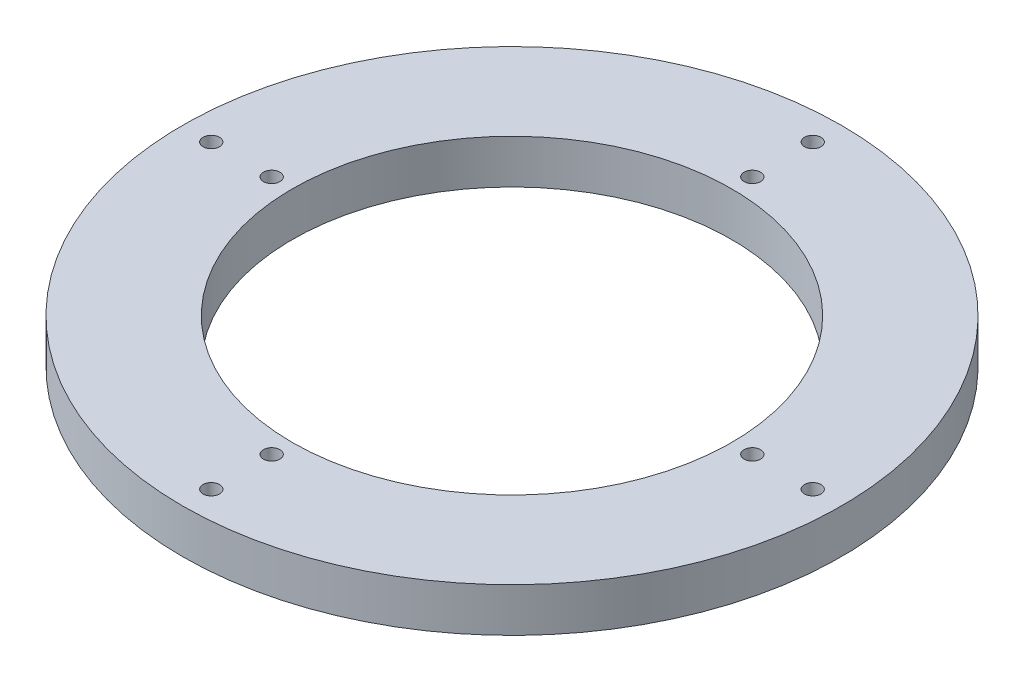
ISO-10303-21;
HEADER;
FILE_DESCRIPTION(('STEP AP214'),'2;1');
FILE_NAME('part.step','',(''),(''),'','','');
FILE_SCHEMA(('AUTOMOTIVE_DESIGN { 1 0 10303 214 1 1 1 1 }'));
ENDSEC;
DATA;
#1=APPLICATION_CONTEXT('core data for automotive mechanical design processes');
#2=APPLICATION_PROTOCOL_DEFINITION('international standard','automotive_design',2000,#1);
#3=PRODUCT_CONTEXT('',#1,'mechanical');
#4=PRODUCT('Part','Part','',(#3));
#5=PRODUCT_RELATED_PRODUCT_CATEGORY('part','',(#4));
#6=PRODUCT_DEFINITION_FORMATION('','',#4);
#7=PRODUCT_DEFINITION_CONTEXT('part definition',#1,'design');
#8=PRODUCT_DEFINITION('design','',#6,#7);
#9=PRODUCT_DEFINITION_SHAPE('','',#8);
#10=(LENGTH_UNIT() NAMED_UNIT(*) SI_UNIT(.MILLI.,.METRE.));
#11=(NAMED_UNIT(*) PLANE_ANGLE_UNIT() SI_UNIT($,.RADIAN.));
#12=(NAMED_UNIT(*) SI_UNIT($,.STERADIAN.) SOLID_ANGLE_UNIT());
#13=UNCERTAINTY_MEASURE_WITH_UNIT(LENGTH_MEASURE(1.E-05),#10,'distance_accuracy_value','');
#14=(GEOMETRIC_REPRESENTATION_CONTEXT(3) GLOBAL_UNCERTAINTY_ASSIGNED_CONTEXT((#13)) GLOBAL_UNIT_ASSIGNED_CONTEXT((#10,
#11,#12)) REPRESENTATION_CONTEXT('',''));
#15=CARTESIAN_POINT('',(0.,0.,0.));
#16=DIRECTION('',(0.,0.,1.));
#17=DIRECTION('',(1.,0.,0.));
#18=AXIS2_PLACEMENT_3D('',#15,#16,#17);
#19=CARTESIAN_POINT('',(0.,8.,0.));
#20=DIRECTION('',(0.,-1.,0.));
#21=DIRECTION('',(0.,0.,-1.));
#22=AXIS2_PLACEMENT_3D('',#19,#20,#21);
#23=CYLINDRICAL_SURFACE('',#22,40.);
#24=CARTESIAN_POINT('',(0.,8.,0.));
#25=DIRECTION('',(0.,1.,0.));
#26=DIRECTION('',(0.,0.,1.));
#27=AXIS2_PLACEMENT_3D('',#24,#25,#26);
#28=CIRCLE('',#27,40.);
#29=CARTESIAN_POINT('',(0.,8.,40.));
#30=VERTEX_POINT('',#29);
#31=EDGE_CURVE('E41',#30,#30,#28,.T.);
#32=ORIENTED_EDGE('',*,*,#31,.T.);
#33=EDGE_LOOP('',(#32));
#34=FACE_BOUND('',#33,.T.);
#35=CARTESIAN_POINT('',(0.,0.,0.));
#36=DIRECTION('',(0.,1.,0.));
#37=DIRECTION('',(0.,0.,1.));
#38=AXIS2_PLACEMENT_3D('',#35,#36,#37);
#39=CIRCLE('',#38,40.);
#40=CARTESIAN_POINT('',(0.,0.,40.));
#41=VERTEX_POINT('',#40);
#42=EDGE_CURVE('E73',#41,#41,#39,.T.);
#43=ORIENTED_EDGE('',*,*,#42,.F.);
#44=EDGE_LOOP('',(#43));
#45=FACE_BOUND('',#44,.T.);
#46=ADVANCED_FACE('F33',(#34,#45),#23,.F.);
#47=CARTESIAN_POINT('',(54.75,8.,0.));
#48=DIRECTION('',(0.,-1.,0.));
#49=DIRECTION('',(0.,0.,-1.));
#50=AXIS2_PLACEMENT_3D('',#47,#48,#49);
#51=CYLINDRICAL_SURFACE('',#50,1.5);
#52=CARTESIAN_POINT('',(54.75,8.,0.));
#53=DIRECTION('',(0.,1.,0.));
#54=DIRECTION('',(0.,0.,1.));
#55=AXIS2_PLACEMENT_3D('',#52,#53,#54);
#56=CIRCLE('',#55,1.5);
#57=CARTESIAN_POINT('',(54.75,8.,1.5));
#58=VERTEX_POINT('',#57);
#59=EDGE_CURVE('E46',#58,#58,#56,.T.);
#60=ORIENTED_EDGE('',*,*,#59,.T.);
#61=EDGE_LOOP('',(#60));
#62=FACE_BOUND('',#61,.T.);
#63=CARTESIAN_POINT('',(54.75,0.,0.));
#64=DIRECTION('',(0.,1.,0.));
#65=DIRECTION('',(0.,0.,1.));
#66=AXIS2_PLACEMENT_3D('',#63,#64,#65);
#67=CIRCLE('',#66,1.5);
#68=CARTESIAN_POINT('',(54.75,0.,1.5));
#69=VERTEX_POINT('',#68);
#70=EDGE_CURVE('E71',#69,#69,#67,.T.);
#71=ORIENTED_EDGE('',*,*,#70,.F.);
#72=EDGE_LOOP('',(#71));
#73=FACE_BOUND('',#72,.T.);
#74=ADVANCED_FACE('F106',(#62,#73),#51,.F.);
#75=CARTESIAN_POINT('',(-1.91158603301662E-13,8.,54.75));
#76=DIRECTION('',(0.,-1.,0.));
#77=DIRECTION('',(0.,0.,-1.));
#78=AXIS2_PLACEMENT_3D('',#75,#76,#77);
#79=CYLINDRICAL_SURFACE('',#78,1.5);
#80=CARTESIAN_POINT('',(-1.91158603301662E-13,8.,54.75));
#81=DIRECTION('',(0.,1.,0.));
#82=DIRECTION('',(0.,0.,1.));
#83=AXIS2_PLACEMENT_3D('',#80,#81,#82);
#84=CIRCLE('',#83,1.5);
#85=CARTESIAN_POINT('',(-1.91158603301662E-13,8.,56.25));
#86=VERTEX_POINT('',#85);
#87=EDGE_CURVE('E101',#86,#86,#84,.T.);
#88=ORIENTED_EDGE('',*,*,#87,.T.);
#89=EDGE_LOOP('',(#88));
#90=FACE_BOUND('',#89,.T.);
#91=CARTESIAN_POINT('',(-1.91158603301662E-13,0.,54.75));
#92=DIRECTION('',(0.,1.,0.));
#93=DIRECTION('',(0.,0.,1.));
#94=AXIS2_PLACEMENT_3D('',#91,#92,#93);
#95=CIRCLE('',#94,1.5);
#96=CARTESIAN_POINT('',(-1.91158603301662E-13,0.,56.25));
#97=VERTEX_POINT('',#96);
#98=EDGE_CURVE('E68',#97,#97,#95,.T.);
#99=ORIENTED_EDGE('',*,*,#98,.F.);
#100=EDGE_LOOP('',(#99));
#101=FACE_BOUND('',#100,.T.);
#102=ADVANCED_FACE('F124',(#90,#101),#79,.F.);
#103=CARTESIAN_POINT('',(-54.75,8.,-3.82317206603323E-13));
#104=DIRECTION('',(0.,-1.,0.));
#105=DIRECTION('',(0.,0.,-1.));
#106=AXIS2_PLACEMENT_3D('',#103,#104,#105);
#107=CYLINDRICAL_SURFACE('',#106,1.5);
#108=CARTESIAN_POINT('',(-54.75,8.,-3.82317206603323E-13));
#109=DIRECTION('',(0.,1.,0.));
#110=DIRECTION('',(0.,0.,1.));
#111=AXIS2_PLACEMENT_3D('',#108,#109,#110);
#112=CIRCLE('',#111,1.5);
#113=CARTESIAN_POINT('',(-54.75,8.,1.49999999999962));
#114=VERTEX_POINT('',#113);
#115=EDGE_CURVE('E98',#114,#114,#112,.T.);
#116=ORIENTED_EDGE('',*,*,#115,.T.);
#117=EDGE_LOOP('',(#116));
#118=FACE_BOUND('',#117,.T.);
#119=CARTESIAN_POINT('',(-54.75,0.,-3.82317206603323E-13));
#120=DIRECTION('',(0.,1.,0.));
#121=DIRECTION('',(0.,0.,1.));
#122=AXIS2_PLACEMENT_3D('',#119,#120,#121);
#123=CIRCLE('',#122,1.5);
#124=CARTESIAN_POINT('',(-54.75,0.,1.49999999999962));
#125=VERTEX_POINT('',#124);
#126=EDGE_CURVE('E65',#125,#125,#123,.T.);
#127=ORIENTED_EDGE('',*,*,#126,.F.);
#128=EDGE_LOOP('',(#127));
#129=FACE_BOUND('',#128,.T.);
#130=ADVANCED_FACE('F131',(#118,#129),#107,.F.);
#131=CARTESIAN_POINT('',(5.73475809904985E-13,8.,-54.75));
#132=DIRECTION('',(0.,-1.,0.));
#133=DIRECTION('',(0.,0.,-1.));
#134=AXIS2_PLACEMENT_3D('',#131,#132,#133);
#135=CYLINDRICAL_SURFACE('',#134,1.50000000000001);
#136=CARTESIAN_POINT('',(5.73475809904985E-13,8.,-54.75));
#137=DIRECTION('',(0.,1.,0.));
#138=DIRECTION('',(0.,0.,1.));
#139=AXIS2_PLACEMENT_3D('',#136,#137,#138);
#140=CIRCLE('',#139,1.50000000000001);
#141=CARTESIAN_POINT('',(5.73475809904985E-13,8.,-53.25));
#142=VERTEX_POINT('',#141);
#143=EDGE_CURVE('E95',#142,#142,#140,.T.);
#144=ORIENTED_EDGE('',*,*,#143,.T.);
#145=EDGE_LOOP('',(#144));
#146=FACE_BOUND('',#145,.T.);
#147=CARTESIAN_POINT('',(5.73475809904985E-13,0.,-54.75));
#148=DIRECTION('',(0.,1.,0.));
#149=DIRECTION('',(0.,0.,1.));
#150=AXIS2_PLACEMENT_3D('',#147,#148,#149);
#151=CIRCLE('',#150,1.50000000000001);
#152=CARTESIAN_POINT('',(5.73475809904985E-13,0.,-53.25));
#153=VERTEX_POINT('',#152);
#154=EDGE_CURVE('E62',#153,#153,#151,.T.);
#155=ORIENTED_EDGE('',*,*,#154,.F.);
#156=EDGE_LOOP('',(#155));
#157=FACE_BOUND('',#156,.T.);
#158=ADVANCED_FACE('F135',(#146,#157),#135,.F.);
#159=CARTESIAN_POINT('',(43.75,8.,0.));
#160=DIRECTION('',(0.,-1.,0.));
#161=DIRECTION('',(0.,0.,-1.));
#162=AXIS2_PLACEMENT_3D('',#159,#160,#161);
#163=CYLINDRICAL_SURFACE('',#162,1.5);
#164=CARTESIAN_POINT('',(43.75,8.,0.));
#165=DIRECTION('',(0.,1.,0.));
#166=DIRECTION('',(0.,0.,1.));
#167=AXIS2_PLACEMENT_3D('',#164,#165,#166);
#168=CIRCLE('',#167,1.5);
#169=CARTESIAN_POINT('',(43.75,8.,1.5));
#170=VERTEX_POINT('',#169);
#171=EDGE_CURVE('E92',#170,#170,#168,.T.);
#172=ORIENTED_EDGE('',*,*,#171,.T.);
#173=EDGE_LOOP('',(#172));
#174=FACE_BOUND('',#173,.T.);
#175=CARTESIAN_POINT('',(43.75,0.,0.));
#176=DIRECTION('',(0.,1.,0.));
#177=DIRECTION('',(0.,0.,1.));
#178=AXIS2_PLACEMENT_3D('',#175,#176,#177);
#179=CIRCLE('',#178,1.5);
#180=CARTESIAN_POINT('',(43.75,0.,1.5));
#181=VERTEX_POINT('',#180);
#182=EDGE_CURVE('E59',#181,#181,#179,.T.);
#183=ORIENTED_EDGE('',*,*,#182,.F.);
#184=EDGE_LOOP('',(#183));
#185=FACE_BOUND('',#184,.T.);
#186=ADVANCED_FACE('F139',(#174,#185),#163,.F.);
#187=CARTESIAN_POINT('',(-1.52752308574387E-13,8.,43.75));
#188=DIRECTION('',(0.,-1.,0.));
#189=DIRECTION('',(0.,0.,-1.));
#190=AXIS2_PLACEMENT_3D('',#187,#188,#189);
#191=CYLINDRICAL_SURFACE('',#190,1.5);
#192=CARTESIAN_POINT('',(-1.52752308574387E-13,8.,43.75));
#193=DIRECTION('',(0.,1.,0.));
#194=DIRECTION('',(0.,0.,1.));
#195=AXIS2_PLACEMENT_3D('',#192,#193,#194);
#196=CIRCLE('',#195,1.5);
#197=CARTESIAN_POINT('',(-1.52752308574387E-13,8.,45.25));
#198=VERTEX_POINT('',#197);
#199=EDGE_CURVE('E87',#198,#198,#196,.T.);
#200=ORIENTED_EDGE('',*,*,#199,.T.);
#201=EDGE_LOOP('',(#200));
#202=FACE_BOUND('',#201,.T.);
#203=CARTESIAN_POINT('',(-1.52752308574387E-13,0.,43.75));
#204=DIRECTION('',(0.,1.,0.));
#205=DIRECTION('',(0.,0.,1.));
#206=AXIS2_PLACEMENT_3D('',#203,#204,#205);
#207=CIRCLE('',#206,1.5);
#208=CARTESIAN_POINT('',(-1.52752308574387E-13,0.,45.25));
#209=VERTEX_POINT('',#208);
#210=EDGE_CURVE('E56',#209,#209,#207,.T.);
#211=ORIENTED_EDGE('',*,*,#210,.F.);
#212=EDGE_LOOP('',(#211));
#213=FACE_BOUND('',#212,.T.);
#214=ADVANCED_FACE('F143',(#202,#213),#191,.F.);
#215=CARTESIAN_POINT('',(-43.75,8.,-3.05504617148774E-13));
#216=DIRECTION('',(0.,-1.,0.));
#217=DIRECTION('',(0.,0.,-1.));
#218=AXIS2_PLACEMENT_3D('',#215,#216,#217);
#219=CYLINDRICAL_SURFACE('',#218,1.5);
#220=CARTESIAN_POINT('',(-43.75,8.,-3.05504617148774E-13));
#221=DIRECTION('',(0.,1.,0.));
#222=DIRECTION('',(0.,0.,1.));
#223=AXIS2_PLACEMENT_3D('',#220,#221,#222);
#224=CIRCLE('',#223,1.5);
#225=CARTESIAN_POINT('',(-43.75,8.,1.4999999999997));
#226=VERTEX_POINT('',#225);
#227=EDGE_CURVE('E82',#226,#226,#224,.T.);
#228=ORIENTED_EDGE('',*,*,#227,.T.);
#229=EDGE_LOOP('',(#228));
#230=FACE_BOUND('',#229,.T.);
#231=CARTESIAN_POINT('',(-43.75,0.,-3.05504617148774E-13));
#232=DIRECTION('',(0.,1.,0.));
#233=DIRECTION('',(0.,0.,1.));
#234=AXIS2_PLACEMENT_3D('',#231,#232,#233);
#235=CIRCLE('',#234,1.5);
#236=CARTESIAN_POINT('',(-43.75,0.,1.4999999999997));
#237=VERTEX_POINT('',#236);
#238=EDGE_CURVE('E53',#237,#237,#235,.T.);
#239=ORIENTED_EDGE('',*,*,#238,.F.);
#240=EDGE_LOOP('',(#239));
#241=FACE_BOUND('',#240,.T.);
#242=ADVANCED_FACE('F146',(#230,#241),#219,.F.);
#243=CARTESIAN_POINT('',(4.58256925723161E-13,8.,-43.75));
#244=DIRECTION('',(0.,-1.,0.));
#245=DIRECTION('',(0.,0.,-1.));
#246=AXIS2_PLACEMENT_3D('',#243,#244,#245);
#247=CYLINDRICAL_SURFACE('',#246,1.50000000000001);
#248=CARTESIAN_POINT('',(4.58256925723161E-13,8.,-43.75));
#249=DIRECTION('',(0.,1.,0.));
#250=DIRECTION('',(0.,0.,1.));
#251=AXIS2_PLACEMENT_3D('',#248,#249,#250);
#252=CIRCLE('',#251,1.50000000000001);
#253=CARTESIAN_POINT('',(4.58256925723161E-13,8.,-42.25));
#254=VERTEX_POINT('',#253);
#255=EDGE_CURVE('E78',#254,#254,#252,.T.);
#256=ORIENTED_EDGE('',*,*,#255,.T.);
#257=EDGE_LOOP('',(#256));
#258=FACE_BOUND('',#257,.T.);
#259=CARTESIAN_POINT('',(4.58256925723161E-13,0.,-43.75));
#260=DIRECTION('',(0.,1.,0.));
#261=DIRECTION('',(0.,0.,1.));
#262=AXIS2_PLACEMENT_3D('',#259,#260,#261);
#263=CIRCLE('',#262,1.50000000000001);
#264=CARTESIAN_POINT('',(4.58256925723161E-13,0.,-42.25));
#265=VERTEX_POINT('',#264);
#266=EDGE_CURVE('E50',#265,#265,#263,.T.);
#267=ORIENTED_EDGE('',*,*,#266,.F.);
#268=EDGE_LOOP('',(#267));
#269=FACE_BOUND('',#268,.T.);
#270=ADVANCED_FACE('F35',(#258,#269),#247,.F.);
#271=CARTESIAN_POINT('',(0.,8.,0.));
#272=DIRECTION('',(0.,-1.,0.));
#273=DIRECTION('',(0.,0.,-1.));
#274=AXIS2_PLACEMENT_3D('',#271,#272,#273);
#275=CYLINDRICAL_SURFACE('',#274,60.);
#276=CARTESIAN_POINT('',(0.,8.,0.));
#277=DIRECTION('',(0.,1.,0.));
#278=DIRECTION('',(0.,0.,1.));
#279=AXIS2_PLACEMENT_3D('',#276,#277,#278);
#280=CIRCLE('',#279,60.);
#281=CARTESIAN_POINT('',(0.,8.,60.));
#282=VERTEX_POINT('',#281);
#283=EDGE_CURVE('E10',#282,#282,#280,.T.);
#284=ORIENTED_EDGE('',*,*,#283,.F.);
#285=EDGE_LOOP('',(#284));
#286=FACE_BOUND('',#285,.T.);
#287=CARTESIAN_POINT('',(0.,0.,0.));
#288=DIRECTION('',(0.,1.,0.));
#289=DIRECTION('',(0.,0.,1.));
#290=AXIS2_PLACEMENT_3D('',#287,#288,#289);
#291=CIRCLE('',#290,60.);
#292=CARTESIAN_POINT('',(0.,0.,60.));
#293=VERTEX_POINT('',#292);
#294=EDGE_CURVE('E37',#293,#293,#291,.T.);
#295=ORIENTED_EDGE('',*,*,#294,.T.);
#296=EDGE_LOOP('',(#295));
#297=FACE_BOUND('',#296,.T.);
#298=ADVANCED_FACE('F113',(#286,#297),#275,.T.);
#299=CARTESIAN_POINT('',(0.,8.,0.));
#300=DIRECTION('',(0.,1.,0.));
#301=DIRECTION('',(0.,0.,1.));
#302=AXIS2_PLACEMENT_3D('',#299,#300,#301);
#303=PLANE('',#302);
#304=ORIENTED_EDGE('',*,*,#255,.F.);
#305=EDGE_LOOP('',(#304));
#306=FACE_BOUND('',#305,.T.);
#307=ORIENTED_EDGE('',*,*,#227,.F.);
#308=EDGE_LOOP('',(#307));
#309=FACE_BOUND('',#308,.T.);
#310=ORIENTED_EDGE('',*,*,#199,.F.);
#311=EDGE_LOOP('',(#310));
#312=FACE_BOUND('',#311,.T.);
#313=ORIENTED_EDGE('',*,*,#171,.F.);
#314=EDGE_LOOP('',(#313));
#315=FACE_BOUND('',#314,.T.);
#316=ORIENTED_EDGE('',*,*,#143,.F.);
#317=EDGE_LOOP('',(#316));
#318=FACE_BOUND('',#317,.T.);
#319=ORIENTED_EDGE('',*,*,#115,.F.);
#320=EDGE_LOOP('',(#319));
#321=FACE_BOUND('',#320,.T.);
#322=ORIENTED_EDGE('',*,*,#87,.F.);
#323=EDGE_LOOP('',(#322));
#324=FACE_BOUND('',#323,.T.);
#325=ORIENTED_EDGE('',*,*,#59,.F.);
#326=EDGE_LOOP('',(#325));
#327=FACE_BOUND('',#326,.T.);
#328=ORIENTED_EDGE('',*,*,#31,.F.);
#329=EDGE_LOOP('',(#328));
#330=FACE_BOUND('',#329,.T.);
#331=ORIENTED_EDGE('',*,*,#283,.T.);
#332=EDGE_LOOP('',(#331));
#333=FACE_BOUND('',#332,.T.);
#334=ADVANCED_FACE('F109',(#306,#309,#312,#315,#318,#321,#324,#327,#330,#333),#303,.T.);
#335=CARTESIAN_POINT('',(0.,0.,0.));
#336=DIRECTION('',(0.,1.,0.));
#337=DIRECTION('',(0.,0.,1.));
#338=AXIS2_PLACEMENT_3D('',#335,#336,#337);
#339=PLANE('',#338);
#340=ORIENTED_EDGE('',*,*,#266,.T.);
#341=EDGE_LOOP('',(#340));
#342=FACE_BOUND('',#341,.T.);
#343=ORIENTED_EDGE('',*,*,#238,.T.);
#344=EDGE_LOOP('',(#343));
#345=FACE_BOUND('',#344,.T.);
#346=ORIENTED_EDGE('',*,*,#210,.T.);
#347=EDGE_LOOP('',(#346));
#348=FACE_BOUND('',#347,.T.);
#349=ORIENTED_EDGE('',*,*,#182,.T.);
#350=EDGE_LOOP('',(#349));
#351=FACE_BOUND('',#350,.T.);
#352=ORIENTED_EDGE('',*,*,#154,.T.);
#353=EDGE_LOOP('',(#352));
#354=FACE_BOUND('',#353,.T.);
#355=ORIENTED_EDGE('',*,*,#126,.T.);
#356=EDGE_LOOP('',(#355));
#357=FACE_BOUND('',#356,.T.);
#358=ORIENTED_EDGE('',*,*,#98,.T.);
#359=EDGE_LOOP('',(#358));
#360=FACE_BOUND('',#359,.T.);
#361=ORIENTED_EDGE('',*,*,#70,.T.);
#362=EDGE_LOOP('',(#361));
#363=FACE_BOUND('',#362,.T.);
#364=ORIENTED_EDGE('',*,*,#42,.T.);
#365=EDGE_LOOP('',(#364));
#366=FACE_BOUND('',#365,.T.);
#367=ORIENTED_EDGE('',*,*,#294,.F.);
#368=EDGE_LOOP('',(#367));
#369=FACE_BOUND('',#368,.T.);
#370=ADVANCED_FACE('F112',(#342,#345,#348,#351,#354,#357,#360,#363,#366,#369),#339,.F.);
#371=CLOSED_SHELL('',(#46,#74,#102,#130,#158,#186,#214,#242,#270,#298,#334,#370));
#372=MANIFOLD_SOLID_BREP('B2',#371);
#373=ADVANCED_BREP_SHAPE_REPRESENTATION('',(#18,#372),#14);
#374=SHAPE_DEFINITION_REPRESENTATION(#9,#373);
ENDSEC;
END-ISO-10303-21;
